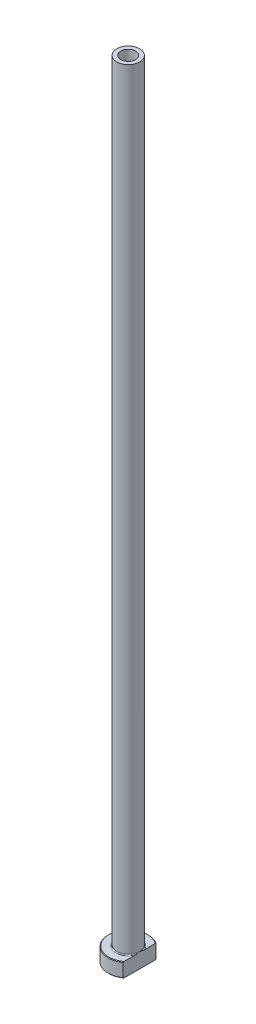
from build123d import *

# Parameters (mm, degrees)
FILLET1_R          = 0.3
CHAMFER1_SIZE      = 0.2
CUT_EXTRUDE1_DEPTH = 276.178124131
CHAMFER2_SIZE      = 0.5


with BuildPart() as part:
    # Sketch1 → Revolve1 (revolve)
    with BuildSketch(Plane.XY, mode=Mode.PRIVATE) as revolve1_sk:
        Polygon((-2.6, 275), (-4, 275), (-4, 5), (-7, 5), (-7, 0), (-2.85, 0), (-2.85, 218), (-2.6, 230), align=None)
    revolve(revolve1_sk.sketch.rotate(Axis((0, 92.187680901, 0), (0, -1, 0)), 270), axis=Axis((0, 92.187680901, 0), (0, -1, 0)))

    # Fillet1
    fillet1_edges = [part.edges().sort_by_distance(p)[0] for p in [
        (0, 5, -4),
    ]]
    fillet(fillet1_edges, radius=FILLET1_R)

    # Chamfer1
    chamfer1_edges = [part.edges().sort_by_distance(p)[0] for p in [
        (0, 0, -7),
        (0, 5, -7),
    ]]
    chamfer(chamfer1_edges, length=CHAMFER1_SIZE)

    # Sketch2 → Cut-Extrude1 (cut, through all)
    with BuildSketch(Plane.XZ):
        with BuildLine():
            Line((4, 5.744562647), (4, -5.744562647))
            ThreePointArc((4, -5.744562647), (7, 0), (4, 5.744562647))
        make_face()
    extrude(amount=-CUT_EXTRUDE1_DEPTH, mode=Mode.SUBTRACT)

    # Chamfer2
    chamfer2_edges = [part.edges().sort_by_distance(p)[0] for p in [
        (0, 0, -2.85),
    ]]
    chamfer(chamfer2_edges, length=CHAMFER2_SIZE)


solid = part.part
